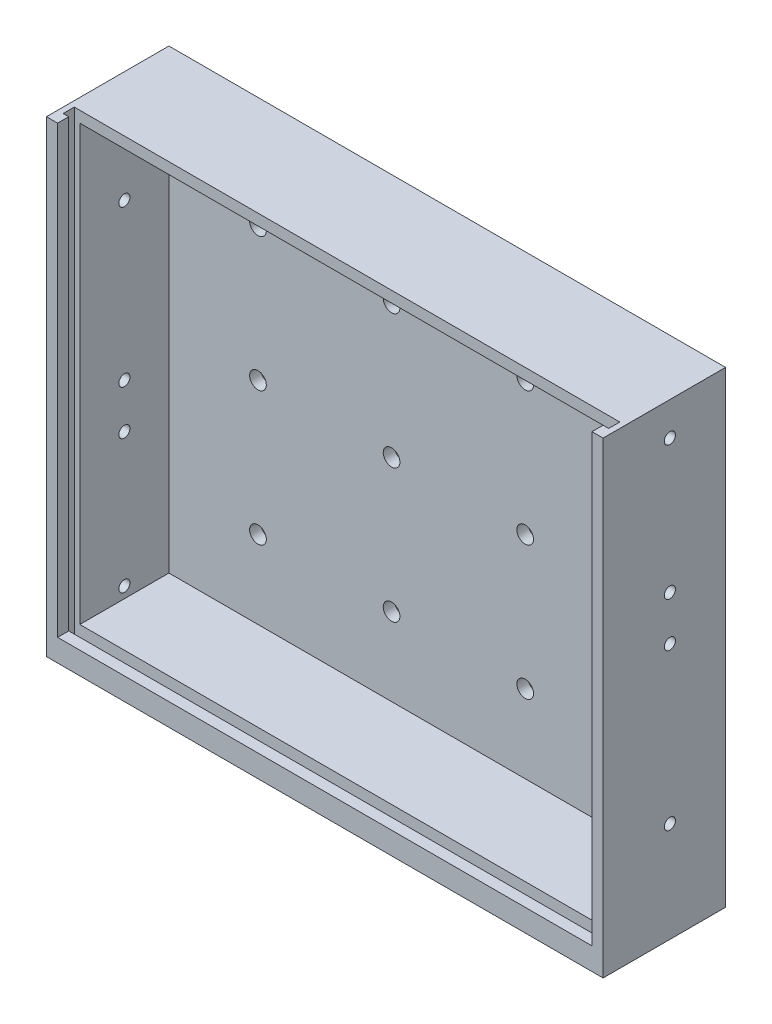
ISO-10303-21;
HEADER;
FILE_DESCRIPTION(('STEP AP214'),'2;1');
FILE_NAME('part.step','',(''),(''),'','','');
FILE_SCHEMA(('AUTOMOTIVE_DESIGN { 1 0 10303 214 1 1 1 1 }'));
ENDSEC;
DATA;
#1=APPLICATION_CONTEXT('core data for automotive mechanical design processes');
#2=APPLICATION_PROTOCOL_DEFINITION('international standard','automotive_design',2000,#1);
#3=PRODUCT_CONTEXT('',#1,'mechanical');
#4=PRODUCT('Part','Part','',(#3));
#5=PRODUCT_RELATED_PRODUCT_CATEGORY('part','',(#4));
#6=PRODUCT_DEFINITION_FORMATION('','',#4);
#7=PRODUCT_DEFINITION_CONTEXT('part definition',#1,'design');
#8=PRODUCT_DEFINITION('design','',#6,#7);
#9=PRODUCT_DEFINITION_SHAPE('','',#8);
#10=(LENGTH_UNIT() NAMED_UNIT(*) SI_UNIT(.MILLI.,.METRE.));
#11=(NAMED_UNIT(*) PLANE_ANGLE_UNIT() SI_UNIT($,.RADIAN.));
#12=(NAMED_UNIT(*) SI_UNIT($,.STERADIAN.) SOLID_ANGLE_UNIT());
#13=UNCERTAINTY_MEASURE_WITH_UNIT(LENGTH_MEASURE(1.E-05),#10,'distance_accuracy_value','');
#14=(GEOMETRIC_REPRESENTATION_CONTEXT(3) GLOBAL_UNCERTAINTY_ASSIGNED_CONTEXT((#13)) GLOBAL_UNIT_ASSIGNED_CONTEXT((#10,
#11,#12)) REPRESENTATION_CONTEXT('',''));
#15=CARTESIAN_POINT('',(0.,0.,0.));
#16=DIRECTION('',(0.,0.,1.));
#17=DIRECTION('',(1.,0.,0.));
#18=AXIS2_PLACEMENT_3D('',#15,#16,#17);
#19=CARTESIAN_POINT('',(0.,0.,6.35));
#20=DIRECTION('',(0.,0.,1.));
#21=DIRECTION('',(1.,0.,0.));
#22=AXIS2_PLACEMENT_3D('',#19,#20,#21);
#23=PLANE('',#22);
#24=CARTESIAN_POINT('',(285.75,-133.35,6.35));
#25=DIRECTION('',(0.,0.,1.));
#26=DIRECTION('',(1.,0.,0.));
#27=AXIS2_PLACEMENT_3D('',#24,#25,#26);
#28=CIRCLE('',#27,4.76250000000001);
#29=CARTESIAN_POINT('',(290.5125,-133.35,6.35));
#30=VERTEX_POINT('',#29);
#31=EDGE_CURVE('E495',#30,#30,#28,.T.);
#32=ORIENTED_EDGE('',*,*,#31,.F.);
#33=EDGE_LOOP('',(#32));
#34=FACE_BOUND('',#33,.T.);
#35=CARTESIAN_POINT('',(133.35,-133.35,6.35));
#36=DIRECTION('',(0.,0.,1.));
#37=DIRECTION('',(1.,0.,0.));
#38=AXIS2_PLACEMENT_3D('',#35,#36,#37);
#39=CIRCLE('',#38,4.7625);
#40=CARTESIAN_POINT('',(138.1125,-133.35,6.35));
#41=VERTEX_POINT('',#40);
#42=EDGE_CURVE('E499',#41,#41,#39,.T.);
#43=ORIENTED_EDGE('',*,*,#42,.F.);
#44=EDGE_LOOP('',(#43));
#45=FACE_BOUND('',#44,.T.);
#46=CARTESIAN_POINT('',(285.75,-209.55,6.35));
#47=DIRECTION('',(0.,0.,1.));
#48=DIRECTION('',(1.,0.,0.));
#49=AXIS2_PLACEMENT_3D('',#46,#47,#48);
#50=CIRCLE('',#49,4.76250000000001);
#51=CARTESIAN_POINT('',(290.5125,-209.55,6.35));
#52=VERTEX_POINT('',#51);
#53=EDGE_CURVE('E483',#52,#52,#50,.T.);
#54=ORIENTED_EDGE('',*,*,#53,.F.);
#55=EDGE_LOOP('',(#54));
#56=FACE_BOUND('',#55,.T.);
#57=CARTESIAN_POINT('',(133.35,-209.55,6.35));
#58=DIRECTION('',(0.,0.,1.));
#59=DIRECTION('',(1.,0.,0.));
#60=AXIS2_PLACEMENT_3D('',#57,#58,#59);
#61=CIRCLE('',#60,4.7625);
#62=CARTESIAN_POINT('',(138.1125,-209.55,6.35));
#63=VERTEX_POINT('',#62);
#64=EDGE_CURVE('E487',#63,#63,#61,.T.);
#65=ORIENTED_EDGE('',*,*,#64,.F.);
#66=EDGE_LOOP('',(#65));
#67=FACE_BOUND('',#66,.T.);
#68=CARTESIAN_POINT('',(285.75,-57.15,6.35));
#69=DIRECTION('',(0.,0.,1.));
#70=DIRECTION('',(1.,0.,0.));
#71=AXIS2_PLACEMENT_3D('',#68,#69,#70);
#72=CIRCLE('',#71,4.76250000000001);
#73=CARTESIAN_POINT('',(290.5125,-57.15,6.35));
#74=VERTEX_POINT('',#73);
#75=EDGE_CURVE('E491',#74,#74,#72,.T.);
#76=ORIENTED_EDGE('',*,*,#75,.F.);
#77=EDGE_LOOP('',(#76));
#78=FACE_BOUND('',#77,.T.);
#79=CARTESIAN_POINT('',(133.35,-57.15,6.35));
#80=DIRECTION('',(0.,0.,1.));
#81=DIRECTION('',(1.,0.,0.));
#82=AXIS2_PLACEMENT_3D('',#79,#80,#81);
#83=CIRCLE('',#82,4.7625);
#84=CARTESIAN_POINT('',(138.1125,-57.15,6.35));
#85=VERTEX_POINT('',#84);
#86=EDGE_CURVE('E479',#85,#85,#83,.T.);
#87=ORIENTED_EDGE('',*,*,#86,.F.);
#88=EDGE_LOOP('',(#87));
#89=FACE_BOUND('',#88,.T.);
#90=CARTESIAN_POINT('',(209.55,-133.35,6.35));
#91=DIRECTION('',(0.,0.,1.));
#92=DIRECTION('',(1.,0.,0.));
#93=AXIS2_PLACEMENT_3D('',#90,#91,#92);
#94=CIRCLE('',#93,4.76250000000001);
#95=CARTESIAN_POINT('',(214.3125,-133.35,6.35));
#96=VERTEX_POINT('',#95);
#97=EDGE_CURVE('E475',#96,#96,#94,.T.);
#98=ORIENTED_EDGE('',*,*,#97,.F.);
#99=EDGE_LOOP('',(#98));
#100=FACE_BOUND('',#99,.T.);
#101=CARTESIAN_POINT('',(57.15,-133.35,6.35));
#102=DIRECTION('',(0.,0.,1.));
#103=DIRECTION('',(1.,0.,0.));
#104=AXIS2_PLACEMENT_3D('',#101,#102,#103);
#105=CIRCLE('',#104,4.7625);
#106=CARTESIAN_POINT('',(61.9125,-133.35,6.35));
#107=VERTEX_POINT('',#106);
#108=EDGE_CURVE('E471',#107,#107,#105,.T.);
#109=ORIENTED_EDGE('',*,*,#108,.F.);
#110=EDGE_LOOP('',(#109));
#111=FACE_BOUND('',#110,.T.);
#112=CARTESIAN_POINT('',(209.55,-57.15,6.35));
#113=DIRECTION('',(0.,0.,1.));
#114=DIRECTION('',(1.,0.,0.));
#115=AXIS2_PLACEMENT_3D('',#112,#113,#114);
#116=CIRCLE('',#115,4.76250000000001);
#117=CARTESIAN_POINT('',(214.3125,-57.15,6.35));
#118=VERTEX_POINT('',#117);
#119=EDGE_CURVE('E410',#118,#118,#116,.T.);
#120=ORIENTED_EDGE('',*,*,#119,.F.);
#121=EDGE_LOOP('',(#120));
#122=FACE_BOUND('',#121,.T.);
#123=CARTESIAN_POINT('',(57.15,-209.55,6.35));
#124=DIRECTION('',(0.,0.,1.));
#125=DIRECTION('',(1.,0.,0.));
#126=AXIS2_PLACEMENT_3D('',#123,#124,#125);
#127=CIRCLE('',#126,4.7625);
#128=CARTESIAN_POINT('',(61.9125,-209.55,6.35));
#129=VERTEX_POINT('',#128);
#130=EDGE_CURVE('E418',#129,#129,#127,.T.);
#131=ORIENTED_EDGE('',*,*,#130,.F.);
#132=EDGE_LOOP('',(#131));
#133=FACE_BOUND('',#132,.T.);
#134=CARTESIAN_POINT('',(209.55,-209.55,6.35));
#135=DIRECTION('',(0.,0.,1.));
#136=DIRECTION('',(1.,0.,0.));
#137=AXIS2_PLACEMENT_3D('',#134,#135,#136);
#138=CIRCLE('',#137,4.76250000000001);
#139=CARTESIAN_POINT('',(214.3125,-209.55,6.35));
#140=VERTEX_POINT('',#139);
#141=EDGE_CURVE('E413',#140,#140,#138,.T.);
#142=ORIENTED_EDGE('',*,*,#141,.F.);
#143=EDGE_LOOP('',(#142));
#144=FACE_BOUND('',#143,.T.);
#145=CARTESIAN_POINT('',(57.15,-57.15,6.35));
#146=DIRECTION('',(0.,0.,1.));
#147=DIRECTION('',(1.,0.,0.));
#148=AXIS2_PLACEMENT_3D('',#145,#146,#147);
#149=CIRCLE('',#148,4.7625);
#150=CARTESIAN_POINT('',(61.9125,-57.15,6.35));
#151=VERTEX_POINT('',#150);
#152=EDGE_CURVE('E264',#151,#151,#149,.T.);
#153=ORIENTED_EDGE('',*,*,#152,.F.);
#154=EDGE_LOOP('',(#153));
#155=FACE_BOUND('',#154,.T.);
#156=DIRECTION('',(0.,1.,0.));
#157=VECTOR('',#156,1.);
#158=CARTESIAN_POINT('',(311.15,0.,6.35));
#159=LINE('',#158,#157);
#160=CARTESIAN_POINT('',(311.15,-254.,6.35));
#161=VERTEX_POINT('',#160);
#162=CARTESIAN_POINT('',(311.15,-6.35000000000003,6.35));
#163=VERTEX_POINT('',#162);
#164=EDGE_CURVE('E195',#161,#163,#159,.T.);
#165=ORIENTED_EDGE('',*,*,#164,.T.);
#166=DIRECTION('',(1.,0.,0.));
#167=VECTOR('',#166,1.);
#168=CARTESIAN_POINT('',(0.,-6.35000000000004,6.35));
#169=LINE('',#168,#167);
#170=CARTESIAN_POINT('',(6.35,-6.35000000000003,6.35));
#171=VERTEX_POINT('',#170);
#172=EDGE_CURVE('E153',#171,#163,#169,.T.);
#173=ORIENTED_EDGE('',*,*,#172,.F.);
#174=DIRECTION('',(0.,-1.,0.));
#175=VECTOR('',#174,1.);
#176=CARTESIAN_POINT('',(6.35,0.,6.35));
#177=LINE('',#176,#175);
#178=CARTESIAN_POINT('',(6.35000000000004,-254.,6.35));
#179=VERTEX_POINT('',#178);
#180=EDGE_CURVE('E162',#171,#179,#177,.T.);
#181=ORIENTED_EDGE('',*,*,#180,.T.);
#182=DIRECTION('',(1.,0.,0.));
#183=VECTOR('',#182,1.);
#184=CARTESIAN_POINT('',(0.,-254.,6.35));
#185=LINE('',#184,#183);
#186=EDGE_CURVE('E190',#179,#161,#185,.T.);
#187=ORIENTED_EDGE('',*,*,#186,.T.);
#188=EDGE_LOOP('',(#165,#173,#181,#187));
#189=FACE_BOUND('',#188,.T.);
#190=ADVANCED_FACE('F35',(#34,#45,#56,#67,#78,#89,#100,#111,#122,#133,#144,#155,#189),#23,.T.);
#191=CARTESIAN_POINT('',(6.35,0.,69.85));
#192=DIRECTION('',(1.,0.,0.));
#193=DIRECTION('',(0.,1.,0.));
#194=AXIS2_PLACEMENT_3D('',#191,#192,#193);
#195=PLANE('',#194);
#196=CARTESIAN_POINT('',(6.35000000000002,-146.05,31.75));
#197=DIRECTION('',(-1.,0.,0.));
#198=DIRECTION('',(0.,-1.,0.));
#199=AXIS2_PLACEMENT_3D('',#196,#197,#198);
#200=CIRCLE('',#199,3.175);
#201=CARTESIAN_POINT('',(6.35000000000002,-149.225,31.75));
#202=VERTEX_POINT('',#201);
#203=EDGE_CURVE('E427',#202,#202,#200,.T.);
#204=ORIENTED_EDGE('',*,*,#203,.T.);
#205=EDGE_LOOP('',(#204));
#206=FACE_BOUND('',#205,.T.);
#207=CARTESIAN_POINT('',(6.35000000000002,-171.45,31.75));
#208=DIRECTION('',(-1.,0.,0.));
#209=DIRECTION('',(0.,-1.,0.));
#210=AXIS2_PLACEMENT_3D('',#207,#208,#209);
#211=CIRCLE('',#210,3.175);
#212=CARTESIAN_POINT('',(6.35000000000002,-174.625,31.75));
#213=VERTEX_POINT('',#212);
#214=EDGE_CURVE('E440',#213,#213,#211,.T.);
#215=ORIENTED_EDGE('',*,*,#214,.T.);
#216=EDGE_LOOP('',(#215));
#217=FACE_BOUND('',#216,.T.);
#218=CARTESIAN_POINT('',(6.35000000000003,-247.65,31.75));
#219=DIRECTION('',(-1.,0.,0.));
#220=DIRECTION('',(0.,-1.,0.));
#221=AXIS2_PLACEMENT_3D('',#218,#219,#220);
#222=CIRCLE('',#221,3.175);
#223=CARTESIAN_POINT('',(6.35000000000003,-250.825,31.75));
#224=VERTEX_POINT('',#223);
#225=EDGE_CURVE('E433',#224,#224,#222,.T.);
#226=ORIENTED_EDGE('',*,*,#225,.T.);
#227=EDGE_LOOP('',(#226));
#228=FACE_BOUND('',#227,.T.);
#229=CARTESIAN_POINT('',(6.35000000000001,-57.15,31.75));
#230=DIRECTION('',(-1.,0.,0.));
#231=DIRECTION('',(0.,-1.,0.));
#232=AXIS2_PLACEMENT_3D('',#229,#230,#231);
#233=CIRCLE('',#232,3.175);
#234=CARTESIAN_POINT('',(6.35000000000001,-60.325,31.75));
#235=VERTEX_POINT('',#234);
#236=EDGE_CURVE('E416',#235,#235,#233,.T.);
#237=ORIENTED_EDGE('',*,*,#236,.T.);
#238=EDGE_LOOP('',(#237));
#239=FACE_BOUND('',#238,.T.);
#240=ORIENTED_EDGE('',*,*,#180,.F.);
#241=DIRECTION('',(0.,0.,-1.));
#242=VECTOR('',#241,1.);
#243=CARTESIAN_POINT('',(6.35,-6.35000000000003,57.15));
#244=LINE('',#243,#242);
#245=CARTESIAN_POINT('',(6.35,-6.35000000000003,57.15));
#246=VERTEX_POINT('',#245);
#247=EDGE_CURVE('E148',#246,#171,#244,.T.);
#248=ORIENTED_EDGE('',*,*,#247,.F.);
#249=DIRECTION('',(0.,1.,0.));
#250=VECTOR('',#249,1.);
#251=CARTESIAN_POINT('',(6.35,0.,57.15));
#252=LINE('',#251,#250);
#253=CARTESIAN_POINT('',(6.35000000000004,-254.,57.15));
#254=VERTEX_POINT('',#253);
#255=EDGE_CURVE('E160',#254,#246,#252,.T.);
#256=ORIENTED_EDGE('',*,*,#255,.F.);
#257=DIRECTION('',(0.,0.,-1.));
#258=VECTOR('',#257,1.);
#259=CARTESIAN_POINT('',(6.35000000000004,-254.,69.85));
#260=LINE('',#259,#258);
#261=EDGE_CURVE('E229',#254,#179,#260,.T.);
#262=ORIENTED_EDGE('',*,*,#261,.T.);
#263=EDGE_LOOP('',(#240,#248,#256,#262));
#264=FACE_BOUND('',#263,.T.);
#265=ADVANCED_FACE('F158',(#206,#217,#228,#239,#264),#195,.T.);
#266=CARTESIAN_POINT('',(311.15,0.,69.85));
#267=DIRECTION('',(-1.,0.,0.));
#268=DIRECTION('',(0.,0.,1.));
#269=AXIS2_PLACEMENT_3D('',#266,#267,#268);
#270=PLANE('',#269);
#271=CARTESIAN_POINT('',(311.15,-120.65,31.75));
#272=DIRECTION('',(1.,0.,0.));
#273=DIRECTION('',(0.,1.,0.));
#274=AXIS2_PLACEMENT_3D('',#271,#272,#273);
#275=CIRCLE('',#274,3.175);
#276=CARTESIAN_POINT('',(311.15,-117.475,31.75));
#277=VERTEX_POINT('',#276);
#278=EDGE_CURVE('E451',#277,#277,#275,.T.);
#279=ORIENTED_EDGE('',*,*,#278,.T.);
#280=EDGE_LOOP('',(#279));
#281=FACE_BOUND('',#280,.T.);
#282=CARTESIAN_POINT('',(311.15,-95.25,31.75));
#283=DIRECTION('',(1.,0.,0.));
#284=DIRECTION('',(0.,1.,0.));
#285=AXIS2_PLACEMENT_3D('',#282,#283,#284);
#286=CIRCLE('',#285,3.175);
#287=CARTESIAN_POINT('',(311.15,-92.075,31.75));
#288=VERTEX_POINT('',#287);
#289=EDGE_CURVE('E463',#288,#288,#286,.T.);
#290=ORIENTED_EDGE('',*,*,#289,.T.);
#291=EDGE_LOOP('',(#290));
#292=FACE_BOUND('',#291,.T.);
#293=CARTESIAN_POINT('',(311.15,-19.05,31.75));
#294=DIRECTION('',(1.,0.,0.));
#295=DIRECTION('',(0.,1.,0.));
#296=AXIS2_PLACEMENT_3D('',#293,#294,#295);
#297=CIRCLE('',#296,3.175);
#298=CARTESIAN_POINT('',(311.15,-15.875,31.75));
#299=VERTEX_POINT('',#298);
#300=EDGE_CURVE('E457',#299,#299,#297,.T.);
#301=ORIENTED_EDGE('',*,*,#300,.T.);
#302=EDGE_LOOP('',(#301));
#303=FACE_BOUND('',#302,.T.);
#304=CARTESIAN_POINT('',(311.15,-209.55,31.75));
#305=DIRECTION('',(1.,0.,0.));
#306=DIRECTION('',(0.,1.,0.));
#307=AXIS2_PLACEMENT_3D('',#304,#305,#306);
#308=CIRCLE('',#307,3.175);
#309=CARTESIAN_POINT('',(311.15,-206.375,31.75));
#310=VERTEX_POINT('',#309);
#311=EDGE_CURVE('E434',#310,#310,#308,.T.);
#312=ORIENTED_EDGE('',*,*,#311,.T.);
#313=EDGE_LOOP('',(#312));
#314=FACE_BOUND('',#313,.T.);
#315=DIRECTION('',(0.,-1.,0.));
#316=VECTOR('',#315,1.);
#317=CARTESIAN_POINT('',(311.15,0.,57.15));
#318=LINE('',#317,#316);
#319=CARTESIAN_POINT('',(311.15,-6.35000000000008,57.15));
#320=VERTEX_POINT('',#319);
#321=CARTESIAN_POINT('',(311.15,-254.,57.15));
#322=VERTEX_POINT('',#321);
#323=EDGE_CURVE('E43',#320,#322,#318,.T.);
#324=ORIENTED_EDGE('',*,*,#323,.F.);
#325=DIRECTION('',(0.,0.,-1.));
#326=VECTOR('',#325,1.);
#327=CARTESIAN_POINT('',(311.15,-6.35000000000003,57.15));
#328=LINE('',#327,#326);
#329=EDGE_CURVE('E50',#320,#163,#328,.T.);
#330=ORIENTED_EDGE('',*,*,#329,.T.);
#331=ORIENTED_EDGE('',*,*,#164,.F.);
#332=DIRECTION('',(0.,0.,-1.));
#333=VECTOR('',#332,1.);
#334=CARTESIAN_POINT('',(311.15,-254.,69.85));
#335=LINE('',#334,#333);
#336=EDGE_CURVE('E214',#322,#161,#335,.T.);
#337=ORIENTED_EDGE('',*,*,#336,.F.);
#338=EDGE_LOOP('',(#324,#330,#331,#337));
#339=FACE_BOUND('',#338,.T.);
#340=ADVANCED_FACE('F259',(#281,#292,#303,#314,#339),#270,.T.);
#341=CARTESIAN_POINT('',(0.,-254.,69.85));
#342=DIRECTION('',(0.,1.,0.));
#343=DIRECTION('',(0.,0.,1.));
#344=AXIS2_PLACEMENT_3D('',#341,#342,#343);
#345=PLANE('',#344);
#346=DIRECTION('',(1.,0.,0.));
#347=VECTOR('',#346,1.);
#348=CARTESIAN_POINT('',(0.,-254.,63.5));
#349=LINE('',#348,#347);
#350=CARTESIAN_POINT('',(6.35000000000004,-254.,63.5));
#351=VERTEX_POINT('',#350);
#352=CARTESIAN_POINT('',(311.15,-254.,63.5));
#353=VERTEX_POINT('',#352);
#354=EDGE_CURVE('E172',#351,#353,#349,.T.);
#355=ORIENTED_EDGE('',*,*,#354,.F.);
#356=CARTESIAN_POINT('',(6.35000000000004,-254.,69.85));
#357=VERTEX_POINT('',#356);
#358=EDGE_CURVE('E230',#357,#351,#260,.T.);
#359=ORIENTED_EDGE('',*,*,#358,.F.);
#360=DIRECTION('',(1.,0.,0.));
#361=VECTOR('',#360,1.);
#362=CARTESIAN_POINT('',(0.,-254.,69.85));
#363=LINE('',#362,#361);
#364=CARTESIAN_POINT('',(311.15,-254.,69.85));
#365=VERTEX_POINT('',#364);
#366=EDGE_CURVE('E191',#357,#365,#363,.T.);
#367=ORIENTED_EDGE('',*,*,#366,.T.);
#368=EDGE_CURVE('E220',#365,#353,#335,.T.);
#369=ORIENTED_EDGE('',*,*,#368,.T.);
#370=EDGE_LOOP('',(#355,#359,#367,#369));
#371=FACE_BOUND('',#370,.T.);
#372=ADVANCED_FACE('F311',(#371),#345,.T.);
#373=DIRECTION('',(0.,-1.,0.));
#374=VECTOR('',#373,1.);
#375=CARTESIAN_POINT('',(6.35,0.,63.5));
#376=LINE('',#375,#374);
#377=CARTESIAN_POINT('',(6.35000000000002,0.,63.5));
#378=VERTEX_POINT('',#377);
#379=EDGE_CURVE('E179',#378,#351,#376,.T.);
#380=ORIENTED_EDGE('',*,*,#379,.F.);
#381=DIRECTION('',(0.,0.,-1.));
#382=VECTOR('',#381,1.);
#383=CARTESIAN_POINT('',(6.35000000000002,0.,69.85));
#384=LINE('',#383,#382);
#385=CARTESIAN_POINT('',(6.35000000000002,0.,69.85));
#386=VERTEX_POINT('',#385);
#387=EDGE_CURVE('E226',#386,#378,#384,.T.);
#388=ORIENTED_EDGE('',*,*,#387,.F.);
#389=DIRECTION('',(0.,-1.,0.));
#390=VECTOR('',#389,1.);
#391=CARTESIAN_POINT('',(6.35,0.,69.85));
#392=LINE('',#391,#390);
#393=EDGE_CURVE('E194',#386,#357,#392,.T.);
#394=ORIENTED_EDGE('',*,*,#393,.T.);
#395=ORIENTED_EDGE('',*,*,#358,.T.);
#396=EDGE_LOOP('',(#380,#388,#394,#395));
#397=FACE_BOUND('',#396,.T.);
#398=ADVANCED_FACE('F307',(#397),#195,.T.);
#399=DIRECTION('',(0.,1.,0.));
#400=VECTOR('',#399,1.);
#401=CARTESIAN_POINT('',(311.15,0.,63.5));
#402=LINE('',#401,#400);
#403=CARTESIAN_POINT('',(311.15,0.,63.5));
#404=VERTEX_POINT('',#403);
#405=EDGE_CURVE('E11',#353,#404,#402,.T.);
#406=ORIENTED_EDGE('',*,*,#405,.F.);
#407=ORIENTED_EDGE('',*,*,#368,.F.);
#408=DIRECTION('',(0.,1.,0.));
#409=VECTOR('',#408,1.);
#410=CARTESIAN_POINT('',(311.15,0.,69.85));
#411=LINE('',#410,#409);
#412=CARTESIAN_POINT('',(311.15,0.,69.85));
#413=VERTEX_POINT('',#412);
#414=EDGE_CURVE('E211',#365,#413,#411,.T.);
#415=ORIENTED_EDGE('',*,*,#414,.T.);
#416=DIRECTION('',(0.,0.,-1.));
#417=VECTOR('',#416,1.);
#418=CARTESIAN_POINT('',(311.15,0.,69.85));
#419=LINE('',#418,#417);
#420=EDGE_CURVE('E223',#413,#404,#419,.T.);
#421=ORIENTED_EDGE('',*,*,#420,.T.);
#422=EDGE_LOOP('',(#406,#407,#415,#421));
#423=FACE_BOUND('',#422,.T.);
#424=ADVANCED_FACE('F317',(#423),#270,.T.);
#425=CARTESIAN_POINT('',(0.,0.,6.35));
#426=DIRECTION('',(1.,0.,0.));
#427=DIRECTION('',(0.,1.,0.));
#428=AXIS2_PLACEMENT_3D('',#425,#426,#427);
#429=PLANE('',#428);
#430=CARTESIAN_POINT('',(0.,-146.05,31.75));
#431=DIRECTION('',(-1.,0.,0.));
#432=DIRECTION('',(0.,-1.,0.));
#433=AXIS2_PLACEMENT_3D('',#430,#431,#432);
#434=CIRCLE('',#433,3.175);
#435=CARTESIAN_POINT('',(0.,-149.225,31.75));
#436=VERTEX_POINT('',#435);
#437=EDGE_CURVE('E443',#436,#436,#434,.T.);
#438=ORIENTED_EDGE('',*,*,#437,.F.);
#439=EDGE_LOOP('',(#438));
#440=FACE_BOUND('',#439,.T.);
#441=CARTESIAN_POINT('',(0.,-171.45,31.75));
#442=DIRECTION('',(-1.,0.,0.));
#443=DIRECTION('',(0.,-1.,0.));
#444=AXIS2_PLACEMENT_3D('',#441,#442,#443);
#445=CIRCLE('',#444,3.175);
#446=CARTESIAN_POINT('',(0.,-174.625,31.75));
#447=VERTEX_POINT('',#446);
#448=EDGE_CURVE('E437',#447,#447,#445,.T.);
#449=ORIENTED_EDGE('',*,*,#448,.F.);
#450=EDGE_LOOP('',(#449));
#451=FACE_BOUND('',#450,.T.);
#452=CARTESIAN_POINT('',(0.,-247.65,31.75));
#453=DIRECTION('',(-1.,0.,0.));
#454=DIRECTION('',(0.,-1.,0.));
#455=AXIS2_PLACEMENT_3D('',#452,#453,#454);
#456=CIRCLE('',#455,3.175);
#457=CARTESIAN_POINT('',(0.,-250.825,31.75));
#458=VERTEX_POINT('',#457);
#459=EDGE_CURVE('E430',#458,#458,#456,.T.);
#460=ORIENTED_EDGE('',*,*,#459,.F.);
#461=EDGE_LOOP('',(#460));
#462=FACE_BOUND('',#461,.T.);
#463=CARTESIAN_POINT('',(0.,-57.15,31.75));
#464=DIRECTION('',(-1.,0.,0.));
#465=DIRECTION('',(0.,-1.,0.));
#466=AXIS2_PLACEMENT_3D('',#463,#464,#465);
#467=CIRCLE('',#466,3.175);
#468=CARTESIAN_POINT('',(0.,-60.325,31.75));
#469=VERTEX_POINT('',#468);
#470=EDGE_CURVE('E424',#469,#469,#467,.T.);
#471=ORIENTED_EDGE('',*,*,#470,.F.);
#472=EDGE_LOOP('',(#471));
#473=FACE_BOUND('',#472,.T.);
#474=DIRECTION('',(0.,-1.,0.));
#475=VECTOR('',#474,1.);
#476=CARTESIAN_POINT('',(0.,0.,0.));
#477=LINE('',#476,#475);
#478=CARTESIAN_POINT('',(0.,0.,0.));
#479=VERTEX_POINT('',#478);
#480=CARTESIAN_POINT('',(0.,-266.7,0.));
#481=VERTEX_POINT('',#480);
#482=EDGE_CURVE('E233',#479,#481,#477,.T.);
#483=ORIENTED_EDGE('',*,*,#482,.T.);
#484=DIRECTION('',(0.,0.,-1.));
#485=VECTOR('',#484,1.);
#486=CARTESIAN_POINT('',(0.,-266.7,6.35));
#487=LINE('',#486,#485);
#488=CARTESIAN_POINT('',(0.,-266.7,69.85));
#489=VERTEX_POINT('',#488);
#490=EDGE_CURVE('E251',#489,#481,#487,.T.);
#491=ORIENTED_EDGE('',*,*,#490,.F.);
#492=DIRECTION('',(0.,-1.,0.));
#493=VECTOR('',#492,1.);
#494=CARTESIAN_POINT('',(0.,0.,69.85));
#495=LINE('',#494,#493);
#496=CARTESIAN_POINT('',(0.,0.,69.85));
#497=VERTEX_POINT('',#496);
#498=EDGE_CURVE('E201',#497,#489,#495,.T.);
#499=ORIENTED_EDGE('',*,*,#498,.F.);
#500=DIRECTION('',(0.,0.,-1.));
#501=VECTOR('',#500,1.);
#502=CARTESIAN_POINT('',(0.,0.,6.35));
#503=LINE('',#502,#501);
#504=EDGE_CURVE('E242',#497,#479,#503,.T.);
#505=ORIENTED_EDGE('',*,*,#504,.T.);
#506=EDGE_LOOP('',(#483,#491,#499,#505));
#507=FACE_BOUND('',#506,.T.);
#508=ADVANCED_FACE('F37',(#440,#451,#462,#473,#507),#429,.F.);
#509=CARTESIAN_POINT('',(0.,-266.7,6.35));
#510=DIRECTION('',(0.,1.,0.));
#511=DIRECTION('',(0.,0.,1.));
#512=AXIS2_PLACEMENT_3D('',#509,#510,#511);
#513=PLANE('',#512);
#514=DIRECTION('',(0.,0.,1.));
#515=VECTOR('',#514,1.);
#516=CARTESIAN_POINT('',(3.17500000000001,-266.7,6.35));
#517=LINE('',#516,#515);
#518=CARTESIAN_POINT('',(3.17500000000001,-266.7,57.15));
#519=VERTEX_POINT('',#518);
#520=CARTESIAN_POINT('',(3.17500000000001,-266.7,63.5));
#521=VERTEX_POINT('',#520);
#522=EDGE_CURVE('E187',#519,#521,#517,.T.);
#523=ORIENTED_EDGE('',*,*,#522,.T.);
#524=DIRECTION('',(1.,0.,0.));
#525=VECTOR('',#524,1.);
#526=CARTESIAN_POINT('',(0.,-266.7,63.5));
#527=LINE('',#526,#525);
#528=CARTESIAN_POINT('',(314.325,-266.7,63.5));
#529=VERTEX_POINT('',#528);
#530=EDGE_CURVE('E181',#521,#529,#527,.T.);
#531=ORIENTED_EDGE('',*,*,#530,.T.);
#532=DIRECTION('',(0.,0.,-1.));
#533=VECTOR('',#532,1.);
#534=CARTESIAN_POINT('',(314.325,-266.7,6.35));
#535=LINE('',#534,#533);
#536=CARTESIAN_POINT('',(314.325,-266.7,57.15));
#537=VERTEX_POINT('',#536);
#538=EDGE_CURVE('E184',#529,#537,#535,.T.);
#539=ORIENTED_EDGE('',*,*,#538,.T.);
#540=DIRECTION('',(-1.,0.,0.));
#541=VECTOR('',#540,1.);
#542=CARTESIAN_POINT('',(0.,-266.7,57.15));
#543=LINE('',#542,#541);
#544=EDGE_CURVE('E169',#537,#519,#543,.T.);
#545=ORIENTED_EDGE('',*,*,#544,.T.);
#546=EDGE_LOOP('',(#523,#531,#539,#545));
#547=FACE_BOUND('',#546,.T.);
#548=DIRECTION('',(1.,0.,0.));
#549=VECTOR('',#548,1.);
#550=CARTESIAN_POINT('',(0.,-266.7,0.));
#551=LINE('',#550,#549);
#552=CARTESIAN_POINT('',(317.5,-266.7,0.));
#553=VERTEX_POINT('',#552);
#554=EDGE_CURVE('E236',#481,#553,#551,.T.);
#555=ORIENTED_EDGE('',*,*,#554,.T.);
#556=DIRECTION('',(0.,0.,-1.));
#557=VECTOR('',#556,1.);
#558=CARTESIAN_POINT('',(317.5,-266.7,6.35));
#559=LINE('',#558,#557);
#560=CARTESIAN_POINT('',(317.5,-266.7,69.85));
#561=VERTEX_POINT('',#560);
#562=EDGE_CURVE('E248',#561,#553,#559,.T.);
#563=ORIENTED_EDGE('',*,*,#562,.F.);
#564=DIRECTION('',(1.,0.,0.));
#565=VECTOR('',#564,1.);
#566=CARTESIAN_POINT('',(0.,-266.7,69.85));
#567=LINE('',#566,#565);
#568=EDGE_CURVE('E205',#489,#561,#567,.T.);
#569=ORIENTED_EDGE('',*,*,#568,.F.);
#570=ORIENTED_EDGE('',*,*,#490,.T.);
#571=EDGE_LOOP('',(#555,#563,#569,#570));
#572=FACE_BOUND('',#571,.T.);
#573=ADVANCED_FACE('F298',(#547,#572),#513,.F.);
#574=CARTESIAN_POINT('',(317.5,0.,6.35));
#575=DIRECTION('',(-1.,0.,0.));
#576=DIRECTION('',(0.,-1.,0.));
#577=AXIS2_PLACEMENT_3D('',#574,#575,#576);
#578=PLANE('',#577);
#579=CARTESIAN_POINT('',(317.5,-120.65,31.75));
#580=DIRECTION('',(1.,0.,0.));
#581=DIRECTION('',(0.,1.,0.));
#582=AXIS2_PLACEMENT_3D('',#579,#580,#581);
#583=CIRCLE('',#582,3.175);
#584=CARTESIAN_POINT('',(317.5,-117.475,31.75));
#585=VERTEX_POINT('',#584);
#586=EDGE_CURVE('E466',#585,#585,#583,.T.);
#587=ORIENTED_EDGE('',*,*,#586,.F.);
#588=EDGE_LOOP('',(#587));
#589=FACE_BOUND('',#588,.T.);
#590=CARTESIAN_POINT('',(317.5,-95.25,31.75));
#591=DIRECTION('',(1.,0.,0.));
#592=DIRECTION('',(0.,1.,0.));
#593=AXIS2_PLACEMENT_3D('',#590,#591,#592);
#594=CIRCLE('',#593,3.175);
#595=CARTESIAN_POINT('',(317.5,-92.075,31.75));
#596=VERTEX_POINT('',#595);
#597=EDGE_CURVE('E460',#596,#596,#594,.T.);
#598=ORIENTED_EDGE('',*,*,#597,.F.);
#599=EDGE_LOOP('',(#598));
#600=FACE_BOUND('',#599,.T.);
#601=CARTESIAN_POINT('',(317.5,-19.05,31.75));
#602=DIRECTION('',(1.,0.,0.));
#603=DIRECTION('',(0.,1.,0.));
#604=AXIS2_PLACEMENT_3D('',#601,#602,#603);
#605=CIRCLE('',#604,3.175);
#606=CARTESIAN_POINT('',(317.5,-15.875,31.75));
#607=VERTEX_POINT('',#606);
#608=EDGE_CURVE('E454',#607,#607,#605,.T.);
#609=ORIENTED_EDGE('',*,*,#608,.F.);
#610=EDGE_LOOP('',(#609));
#611=FACE_BOUND('',#610,.T.);
#612=CARTESIAN_POINT('',(317.5,-209.55,31.75));
#613=DIRECTION('',(1.,0.,0.));
#614=DIRECTION('',(0.,1.,0.));
#615=AXIS2_PLACEMENT_3D('',#612,#613,#614);
#616=CIRCLE('',#615,3.175);
#617=CARTESIAN_POINT('',(317.5,-206.375,31.75));
#618=VERTEX_POINT('',#617);
#619=EDGE_CURVE('E448',#618,#618,#616,.T.);
#620=ORIENTED_EDGE('',*,*,#619,.F.);
#621=EDGE_LOOP('',(#620));
#622=FACE_BOUND('',#621,.T.);
#623=DIRECTION('',(0.,1.,0.));
#624=VECTOR('',#623,1.);
#625=CARTESIAN_POINT('',(317.5,0.,0.));
#626=LINE('',#625,#624);
#627=CARTESIAN_POINT('',(317.5,0.,0.));
#628=VERTEX_POINT('',#627);
#629=EDGE_CURVE('E238',#553,#628,#626,.T.);
#630=ORIENTED_EDGE('',*,*,#629,.T.);
#631=DIRECTION('',(0.,0.,-1.));
#632=VECTOR('',#631,1.);
#633=CARTESIAN_POINT('',(317.5,0.,6.35));
#634=LINE('',#633,#632);
#635=CARTESIAN_POINT('',(317.5,0.,69.85));
#636=VERTEX_POINT('',#635);
#637=EDGE_CURVE('E245',#636,#628,#634,.T.);
#638=ORIENTED_EDGE('',*,*,#637,.F.);
#639=DIRECTION('',(0.,1.,0.));
#640=VECTOR('',#639,1.);
#641=CARTESIAN_POINT('',(317.5,0.,69.85));
#642=LINE('',#641,#640);
#643=EDGE_CURVE('E208',#561,#636,#642,.T.);
#644=ORIENTED_EDGE('',*,*,#643,.F.);
#645=ORIENTED_EDGE('',*,*,#562,.T.);
#646=EDGE_LOOP('',(#630,#638,#644,#645));
#647=FACE_BOUND('',#646,.T.);
#648=ADVANCED_FACE('F328',(#589,#600,#611,#622,#647),#578,.F.);
#649=CARTESIAN_POINT('',(0.,0.,6.35));
#650=DIRECTION('',(0.,-1.,0.));
#651=DIRECTION('',(0.,0.,-1.));
#652=AXIS2_PLACEMENT_3D('',#649,#650,#651);
#653=PLANE('',#652);
#654=ORIENTED_EDGE('',*,*,#387,.T.);
#655=DIRECTION('',(1.,0.,0.));
#656=VECTOR('',#655,1.);
#657=CARTESIAN_POINT('',(314.325,0.,63.5));
#658=LINE('',#657,#656);
#659=CARTESIAN_POINT('',(3.17500000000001,0.,63.5));
#660=VERTEX_POINT('',#659);
#661=EDGE_CURVE('E269',#660,#378,#658,.T.);
#662=ORIENTED_EDGE('',*,*,#661,.F.);
#663=DIRECTION('',(0.,0.,1.));
#664=VECTOR('',#663,1.);
#665=CARTESIAN_POINT('',(3.17500000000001,0.,63.5));
#666=LINE('',#665,#664);
#667=CARTESIAN_POINT('',(3.17500000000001,0.,57.15));
#668=VERTEX_POINT('',#667);
#669=EDGE_CURVE('E276',#668,#660,#666,.T.);
#670=ORIENTED_EDGE('',*,*,#669,.F.);
#671=DIRECTION('',(-1.,0.,0.));
#672=VECTOR('',#671,1.);
#673=CARTESIAN_POINT('',(3.17500000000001,0.,57.15));
#674=LINE('',#673,#672);
#675=CARTESIAN_POINT('',(314.325,0.,57.15));
#676=VERTEX_POINT('',#675);
#677=EDGE_CURVE('E273',#676,#668,#674,.T.);
#678=ORIENTED_EDGE('',*,*,#677,.F.);
#679=DIRECTION('',(0.,0.,-1.));
#680=VECTOR('',#679,1.);
#681=CARTESIAN_POINT('',(314.325,0.,57.15));
#682=LINE('',#681,#680);
#683=CARTESIAN_POINT('',(314.325,0.,63.5));
#684=VERTEX_POINT('',#683);
#685=EDGE_CURVE('E271',#684,#676,#682,.T.);
#686=ORIENTED_EDGE('',*,*,#685,.F.);
#687=EDGE_CURVE('E163',#404,#684,#658,.T.);
#688=ORIENTED_EDGE('',*,*,#687,.F.);
#689=ORIENTED_EDGE('',*,*,#420,.F.);
#690=DIRECTION('',(-1.,0.,0.));
#691=VECTOR('',#690,1.);
#692=CARTESIAN_POINT('',(0.,0.,69.85));
#693=LINE('',#692,#691);
#694=EDGE_CURVE('E202',#636,#413,#693,.T.);
#695=ORIENTED_EDGE('',*,*,#694,.F.);
#696=ORIENTED_EDGE('',*,*,#637,.T.);
#697=DIRECTION('',(-1.,0.,0.));
#698=VECTOR('',#697,1.);
#699=CARTESIAN_POINT('',(0.,0.,0.));
#700=LINE('',#699,#698);
#701=EDGE_CURVE('E240',#628,#479,#700,.T.);
#702=ORIENTED_EDGE('',*,*,#701,.T.);
#703=ORIENTED_EDGE('',*,*,#504,.F.);
#704=EDGE_CURVE('E198',#386,#497,#693,.T.);
#705=ORIENTED_EDGE('',*,*,#704,.F.);
#706=EDGE_LOOP('',(#654,#662,#670,#678,#686,#688,#689,#695,#696,#702,#703,#705));
#707=FACE_BOUND('',#706,.T.);
#708=ADVANCED_FACE('F293',(#707),#653,.F.);
#709=CARTESIAN_POINT('',(0.,0.,0.));
#710=DIRECTION('',(0.,0.,1.));
#711=DIRECTION('',(1.,0.,0.));
#712=AXIS2_PLACEMENT_3D('',#709,#710,#711);
#713=PLANE('',#712);
#714=CARTESIAN_POINT('',(285.75,-133.35,0.));
#715=DIRECTION('',(0.,0.,1.));
#716=DIRECTION('',(1.,0.,0.));
#717=AXIS2_PLACEMENT_3D('',#714,#715,#716);
#718=CIRCLE('',#717,4.76250000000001);
#719=CARTESIAN_POINT('',(290.5125,-133.35,0.));
#720=VERTEX_POINT('',#719);
#721=EDGE_CURVE('E359',#720,#720,#718,.T.);
#722=ORIENTED_EDGE('',*,*,#721,.T.);
#723=EDGE_LOOP('',(#722));
#724=FACE_BOUND('',#723,.T.);
#725=CARTESIAN_POINT('',(133.35,-133.35,0.));
#726=DIRECTION('',(0.,0.,1.));
#727=DIRECTION('',(1.,0.,0.));
#728=AXIS2_PLACEMENT_3D('',#725,#726,#727);
#729=CIRCLE('',#728,4.7625);
#730=CARTESIAN_POINT('',(138.1125,-133.35,0.));
#731=VERTEX_POINT('',#730);
#732=EDGE_CURVE('E363',#731,#731,#729,.T.);
#733=ORIENTED_EDGE('',*,*,#732,.T.);
#734=EDGE_LOOP('',(#733));
#735=FACE_BOUND('',#734,.T.);
#736=CARTESIAN_POINT('',(285.75,-209.55,0.));
#737=DIRECTION('',(0.,0.,1.));
#738=DIRECTION('',(1.,0.,0.));
#739=AXIS2_PLACEMENT_3D('',#736,#737,#738);
#740=CIRCLE('',#739,4.76250000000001);
#741=CARTESIAN_POINT('',(290.5125,-209.55,0.));
#742=VERTEX_POINT('',#741);
#743=EDGE_CURVE('E367',#742,#742,#740,.T.);
#744=ORIENTED_EDGE('',*,*,#743,.T.);
#745=EDGE_LOOP('',(#744));
#746=FACE_BOUND('',#745,.T.);
#747=CARTESIAN_POINT('',(133.35,-209.55,0.));
#748=DIRECTION('',(0.,0.,1.));
#749=DIRECTION('',(1.,0.,0.));
#750=AXIS2_PLACEMENT_3D('',#747,#748,#749);
#751=CIRCLE('',#750,4.7625);
#752=CARTESIAN_POINT('',(138.1125,-209.55,0.));
#753=VERTEX_POINT('',#752);
#754=EDGE_CURVE('E371',#753,#753,#751,.T.);
#755=ORIENTED_EDGE('',*,*,#754,.T.);
#756=EDGE_LOOP('',(#755));
#757=FACE_BOUND('',#756,.T.);
#758=CARTESIAN_POINT('',(285.75,-57.15,0.));
#759=DIRECTION('',(0.,0.,1.));
#760=DIRECTION('',(1.,0.,0.));
#761=AXIS2_PLACEMENT_3D('',#758,#759,#760);
#762=CIRCLE('',#761,4.76250000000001);
#763=CARTESIAN_POINT('',(290.5125,-57.15,0.));
#764=VERTEX_POINT('',#763);
#765=EDGE_CURVE('E375',#764,#764,#762,.T.);
#766=ORIENTED_EDGE('',*,*,#765,.T.);
#767=EDGE_LOOP('',(#766));
#768=FACE_BOUND('',#767,.T.);
#769=CARTESIAN_POINT('',(133.35,-57.15,0.));
#770=DIRECTION('',(0.,0.,1.));
#771=DIRECTION('',(1.,0.,0.));
#772=AXIS2_PLACEMENT_3D('',#769,#770,#771);
#773=CIRCLE('',#772,4.7625);
#774=CARTESIAN_POINT('',(138.1125,-57.15,0.));
#775=VERTEX_POINT('',#774);
#776=EDGE_CURVE('E379',#775,#775,#773,.T.);
#777=ORIENTED_EDGE('',*,*,#776,.T.);
#778=EDGE_LOOP('',(#777));
#779=FACE_BOUND('',#778,.T.);
#780=CARTESIAN_POINT('',(209.55,-133.35,0.));
#781=DIRECTION('',(0.,0.,1.));
#782=DIRECTION('',(1.,0.,0.));
#783=AXIS2_PLACEMENT_3D('',#780,#781,#782);
#784=CIRCLE('',#783,4.76250000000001);
#785=CARTESIAN_POINT('',(214.3125,-133.35,0.));
#786=VERTEX_POINT('',#785);
#787=EDGE_CURVE('E383',#786,#786,#784,.T.);
#788=ORIENTED_EDGE('',*,*,#787,.T.);
#789=EDGE_LOOP('',(#788));
#790=FACE_BOUND('',#789,.T.);
#791=CARTESIAN_POINT('',(57.15,-133.35,0.));
#792=DIRECTION('',(0.,0.,1.));
#793=DIRECTION('',(1.,0.,0.));
#794=AXIS2_PLACEMENT_3D('',#791,#792,#793);
#795=CIRCLE('',#794,4.7625);
#796=CARTESIAN_POINT('',(61.9125,-133.35,0.));
#797=VERTEX_POINT('',#796);
#798=EDGE_CURVE('E387',#797,#797,#795,.T.);
#799=ORIENTED_EDGE('',*,*,#798,.T.);
#800=EDGE_LOOP('',(#799));
#801=FACE_BOUND('',#800,.T.);
#802=CARTESIAN_POINT('',(209.55,-57.15,0.));
#803=DIRECTION('',(0.,0.,1.));
#804=DIRECTION('',(1.,0.,0.));
#805=AXIS2_PLACEMENT_3D('',#802,#803,#804);
#806=CIRCLE('',#805,4.76250000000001);
#807=CARTESIAN_POINT('',(214.3125,-57.15,0.));
#808=VERTEX_POINT('',#807);
#809=EDGE_CURVE('E391',#808,#808,#806,.T.);
#810=ORIENTED_EDGE('',*,*,#809,.T.);
#811=EDGE_LOOP('',(#810));
#812=FACE_BOUND('',#811,.T.);
#813=CARTESIAN_POINT('',(57.15,-209.55,0.));
#814=DIRECTION('',(0.,0.,1.));
#815=DIRECTION('',(1.,0.,0.));
#816=AXIS2_PLACEMENT_3D('',#813,#814,#815);
#817=CIRCLE('',#816,4.7625);
#818=CARTESIAN_POINT('',(61.9125,-209.55,0.));
#819=VERTEX_POINT('',#818);
#820=EDGE_CURVE('E395',#819,#819,#817,.T.);
#821=ORIENTED_EDGE('',*,*,#820,.T.);
#822=EDGE_LOOP('',(#821));
#823=FACE_BOUND('',#822,.T.);
#824=CARTESIAN_POINT('',(209.55,-209.55,0.));
#825=DIRECTION('',(0.,0.,1.));
#826=DIRECTION('',(1.,0.,0.));
#827=AXIS2_PLACEMENT_3D('',#824,#825,#826);
#828=CIRCLE('',#827,4.76250000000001);
#829=CARTESIAN_POINT('',(214.3125,-209.55,0.));
#830=VERTEX_POINT('',#829);
#831=EDGE_CURVE('E399',#830,#830,#828,.T.);
#832=ORIENTED_EDGE('',*,*,#831,.T.);
#833=EDGE_LOOP('',(#832));
#834=FACE_BOUND('',#833,.T.);
#835=CARTESIAN_POINT('',(57.15,-57.15,0.));
#836=DIRECTION('',(0.,0.,1.));
#837=DIRECTION('',(1.,0.,0.));
#838=AXIS2_PLACEMENT_3D('',#835,#836,#837);
#839=CIRCLE('',#838,4.7625);
#840=CARTESIAN_POINT('',(61.9125,-57.15,0.));
#841=VERTEX_POINT('',#840);
#842=EDGE_CURVE('E261',#841,#841,#839,.T.);
#843=ORIENTED_EDGE('',*,*,#842,.T.);
#844=EDGE_LOOP('',(#843));
#845=FACE_BOUND('',#844,.T.);
#846=ORIENTED_EDGE('',*,*,#482,.F.);
#847=ORIENTED_EDGE('',*,*,#701,.F.);
#848=ORIENTED_EDGE('',*,*,#629,.F.);
#849=ORIENTED_EDGE('',*,*,#554,.F.);
#850=EDGE_LOOP('',(#846,#847,#848,#849));
#851=FACE_BOUND('',#850,.T.);
#852=ADVANCED_FACE('F324',(#724,#735,#746,#757,#768,#779,#790,#801,#812,#823,#834,#845,#851),
#713,.F.);
#853=DIRECTION('',(-1.,0.,0.));
#854=VECTOR('',#853,1.);
#855=CARTESIAN_POINT('',(0.,-254.,57.15));
#856=LINE('',#855,#854);
#857=EDGE_CURVE('E168',#322,#254,#856,.T.);
#858=ORIENTED_EDGE('',*,*,#857,.F.);
#859=ORIENTED_EDGE('',*,*,#336,.T.);
#860=ORIENTED_EDGE('',*,*,#186,.F.);
#861=ORIENTED_EDGE('',*,*,#261,.F.);
#862=EDGE_LOOP('',(#858,#859,#860,#861));
#863=FACE_BOUND('',#862,.T.);
#864=ADVANCED_FACE('F256',(#863),#345,.T.);
#865=CARTESIAN_POINT('',(0.,0.,69.85));
#866=DIRECTION('',(0.,0.,1.));
#867=DIRECTION('',(1.,0.,0.));
#868=AXIS2_PLACEMENT_3D('',#865,#866,#867);
#869=PLANE('',#868);
#870=ORIENTED_EDGE('',*,*,#366,.F.);
#871=ORIENTED_EDGE('',*,*,#393,.F.);
#872=ORIENTED_EDGE('',*,*,#704,.T.);
#873=ORIENTED_EDGE('',*,*,#498,.T.);
#874=ORIENTED_EDGE('',*,*,#568,.T.);
#875=ORIENTED_EDGE('',*,*,#643,.T.);
#876=ORIENTED_EDGE('',*,*,#694,.T.);
#877=ORIENTED_EDGE('',*,*,#414,.F.);
#878=EDGE_LOOP('',(#870,#871,#872,#873,#874,#875,#876,#877));
#879=FACE_BOUND('',#878,.T.);
#880=ADVANCED_FACE('F314',(#879),#869,.T.);
#881=CARTESIAN_POINT('',(3.17500000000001,-314.325,63.5));
#882=DIRECTION('',(-1.,0.,0.));
#883=DIRECTION('',(0.,0.,1.));
#884=AXIS2_PLACEMENT_3D('',#881,#882,#883);
#885=PLANE('',#884);
#886=DIRECTION('',(0.,1.,0.));
#887=VECTOR('',#886,1.);
#888=CARTESIAN_POINT('',(3.17500000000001,-314.325,57.15));
#889=LINE('',#888,#887);
#890=EDGE_CURVE('E281',#519,#668,#889,.T.);
#891=ORIENTED_EDGE('',*,*,#890,.T.);
#892=ORIENTED_EDGE('',*,*,#669,.T.);
#893=DIRECTION('',(0.,1.,0.));
#894=VECTOR('',#893,1.);
#895=CARTESIAN_POINT('',(3.17500000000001,-314.325,63.5));
#896=LINE('',#895,#894);
#897=EDGE_CURVE('E174',#521,#660,#896,.T.);
#898=ORIENTED_EDGE('',*,*,#897,.F.);
#899=ORIENTED_EDGE('',*,*,#522,.F.);
#900=EDGE_LOOP('',(#891,#892,#898,#899));
#901=FACE_BOUND('',#900,.T.);
#902=ADVANCED_FACE('F302',(#901),#885,.F.);
#903=CARTESIAN_POINT('',(314.325,-314.325,57.15));
#904=DIRECTION('',(1.,0.,0.));
#905=DIRECTION('',(0.,0.,-1.));
#906=AXIS2_PLACEMENT_3D('',#903,#904,#905);
#907=PLANE('',#906);
#908=DIRECTION('',(0.,1.,0.));
#909=VECTOR('',#908,1.);
#910=CARTESIAN_POINT('',(314.325,-314.325,63.5));
#911=LINE('',#910,#909);
#912=EDGE_CURVE('E279',#529,#684,#911,.T.);
#913=ORIENTED_EDGE('',*,*,#912,.T.);
#914=ORIENTED_EDGE('',*,*,#685,.T.);
#915=DIRECTION('',(0.,1.,0.));
#916=VECTOR('',#915,1.);
#917=CARTESIAN_POINT('',(314.325,-314.325,57.15));
#918=LINE('',#917,#916);
#919=EDGE_CURVE('E58',#537,#676,#918,.T.);
#920=ORIENTED_EDGE('',*,*,#919,.F.);
#921=ORIENTED_EDGE('',*,*,#538,.F.);
#922=EDGE_LOOP('',(#913,#914,#920,#921));
#923=FACE_BOUND('',#922,.T.);
#924=ADVANCED_FACE('F285',(#923),#907,.F.);
#925=CARTESIAN_POINT('',(314.325,-314.325,63.5));
#926=DIRECTION('',(0.,0.,1.));
#927=DIRECTION('',(1.,0.,0.));
#928=AXIS2_PLACEMENT_3D('',#925,#926,#927);
#929=PLANE('',#928);
#930=ORIENTED_EDGE('',*,*,#897,.T.);
#931=ORIENTED_EDGE('',*,*,#661,.T.);
#932=ORIENTED_EDGE('',*,*,#379,.T.);
#933=ORIENTED_EDGE('',*,*,#354,.T.);
#934=ORIENTED_EDGE('',*,*,#405,.T.);
#935=ORIENTED_EDGE('',*,*,#687,.T.);
#936=ORIENTED_EDGE('',*,*,#912,.F.);
#937=ORIENTED_EDGE('',*,*,#530,.F.);
#938=EDGE_LOOP('',(#930,#931,#932,#933,#934,#935,#936,#937));
#939=FACE_BOUND('',#938,.T.);
#940=ADVANCED_FACE('F289',(#939),#929,.F.);
#941=CARTESIAN_POINT('',(3.17500000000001,-314.325,57.15));
#942=DIRECTION('',(0.,0.,-1.));
#943=DIRECTION('',(-1.,0.,0.));
#944=AXIS2_PLACEMENT_3D('',#941,#942,#943);
#945=PLANE('',#944);
#946=ORIENTED_EDGE('',*,*,#255,.T.);
#947=DIRECTION('',(1.,0.,0.));
#948=VECTOR('',#947,1.);
#949=CARTESIAN_POINT('',(0.,-6.35000000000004,57.15));
#950=LINE('',#949,#948);
#951=EDGE_CURVE('E145',#246,#320,#950,.T.);
#952=ORIENTED_EDGE('',*,*,#951,.T.);
#953=ORIENTED_EDGE('',*,*,#323,.T.);
#954=ORIENTED_EDGE('',*,*,#857,.T.);
#955=EDGE_LOOP('',(#946,#952,#953,#954));
#956=FACE_BOUND('',#955,.T.);
#957=ORIENTED_EDGE('',*,*,#919,.T.);
#958=ORIENTED_EDGE('',*,*,#677,.T.);
#959=ORIENTED_EDGE('',*,*,#890,.F.);
#960=ORIENTED_EDGE('',*,*,#544,.F.);
#961=EDGE_LOOP('',(#957,#958,#959,#960));
#962=FACE_BOUND('',#961,.T.);
#963=ADVANCED_FACE('F165',(#956,#962),#945,.F.);
#964=CARTESIAN_POINT('',(0.,-6.35000000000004,57.15));
#965=DIRECTION('',(0.,1.,0.));
#966=DIRECTION('',(-1.,0.,0.));
#967=AXIS2_PLACEMENT_3D('',#964,#965,#966);
#968=PLANE('',#967);
#969=ORIENTED_EDGE('',*,*,#172,.T.);
#970=ORIENTED_EDGE('',*,*,#329,.F.);
#971=ORIENTED_EDGE('',*,*,#951,.F.);
#972=ORIENTED_EDGE('',*,*,#247,.T.);
#973=EDGE_LOOP('',(#969,#970,#971,#972));
#974=FACE_BOUND('',#973,.T.);
#975=ADVANCED_FACE('F147',(#974),#968,.F.);
#976=CARTESIAN_POINT('',(57.15,-57.15,0.));
#977=DIRECTION('',(0.,0.,1.));
#978=DIRECTION('',(1.,0.,0.));
#979=AXIS2_PLACEMENT_3D('',#976,#977,#978);
#980=CYLINDRICAL_SURFACE('',#979,4.7625);
#981=ORIENTED_EDGE('',*,*,#842,.F.);
#982=EDGE_LOOP('',(#981));
#983=FACE_BOUND('',#982,.T.);
#984=ORIENTED_EDGE('',*,*,#152,.T.);
#985=EDGE_LOOP('',(#984));
#986=FACE_BOUND('',#985,.T.);
#987=ADVANCED_FACE('F402',(#983,#986),#980,.F.);
#988=CARTESIAN_POINT('',(209.55,-209.55,0.));
#989=DIRECTION('',(0.,0.,1.));
#990=DIRECTION('',(1.,0.,0.));
#991=AXIS2_PLACEMENT_3D('',#988,#989,#990);
#992=CYLINDRICAL_SURFACE('',#991,4.76250000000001);
#993=ORIENTED_EDGE('',*,*,#831,.F.);
#994=EDGE_LOOP('',(#993));
#995=FACE_BOUND('',#994,.T.);
#996=ORIENTED_EDGE('',*,*,#141,.T.);
#997=EDGE_LOOP('',(#996));
#998=FACE_BOUND('',#997,.T.);
#999=ADVANCED_FACE('F405',(#995,#998),#992,.F.);
#1000=CARTESIAN_POINT('',(57.15,-209.55,0.));
#1001=DIRECTION('',(0.,0.,1.));
#1002=DIRECTION('',(1.,0.,0.));
#1003=AXIS2_PLACEMENT_3D('',#1000,#1001,#1002);
#1004=CYLINDRICAL_SURFACE('',#1003,4.7625);
#1005=ORIENTED_EDGE('',*,*,#820,.F.);
#1006=EDGE_LOOP('',(#1005));
#1007=FACE_BOUND('',#1006,.T.);
#1008=ORIENTED_EDGE('',*,*,#130,.T.);
#1009=EDGE_LOOP('',(#1008));
#1010=FACE_BOUND('',#1009,.T.);
#1011=ADVANCED_FACE('F525',(#1007,#1010),#1004,.F.);
#1012=CARTESIAN_POINT('',(209.55,-57.15,0.));
#1013=DIRECTION('',(0.,0.,1.));
#1014=DIRECTION('',(1.,0.,0.));
#1015=AXIS2_PLACEMENT_3D('',#1012,#1013,#1014);
#1016=CYLINDRICAL_SURFACE('',#1015,4.76250000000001);
#1017=ORIENTED_EDGE('',*,*,#809,.F.);
#1018=EDGE_LOOP('',(#1017));
#1019=FACE_BOUND('',#1018,.T.);
#1020=ORIENTED_EDGE('',*,*,#119,.T.);
#1021=EDGE_LOOP('',(#1020));
#1022=FACE_BOUND('',#1021,.T.);
#1023=ADVANCED_FACE('F531',(#1019,#1022),#1016,.F.);
#1024=CARTESIAN_POINT('',(6.35000000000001,-57.15,31.75));
#1025=DIRECTION('',(-1.,0.,0.));
#1026=DIRECTION('',(0.,-1.,0.));
#1027=AXIS2_PLACEMENT_3D('',#1024,#1025,#1026);
#1028=CYLINDRICAL_SURFACE('',#1027,3.175);
#1029=ORIENTED_EDGE('',*,*,#236,.F.);
#1030=EDGE_LOOP('',(#1029));
#1031=FACE_BOUND('',#1030,.T.);
#1032=ORIENTED_EDGE('',*,*,#470,.T.);
#1033=EDGE_LOOP('',(#1032));
#1034=FACE_BOUND('',#1033,.T.);
#1035=ADVANCED_FACE('F622',(#1031,#1034),#1028,.F.);
#1036=CARTESIAN_POINT('',(6.35000000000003,-247.65,31.75));
#1037=DIRECTION('',(-1.,0.,0.));
#1038=DIRECTION('',(0.,-1.,0.));
#1039=AXIS2_PLACEMENT_3D('',#1036,#1037,#1038);
#1040=CYLINDRICAL_SURFACE('',#1039,3.175);
#1041=ORIENTED_EDGE('',*,*,#225,.F.);
#1042=EDGE_LOOP('',(#1041));
#1043=FACE_BOUND('',#1042,.T.);
#1044=ORIENTED_EDGE('',*,*,#459,.T.);
#1045=EDGE_LOOP('',(#1044));
#1046=FACE_BOUND('',#1045,.T.);
#1047=ADVANCED_FACE('F647',(#1043,#1046),#1040,.F.);
#1048=CARTESIAN_POINT('',(6.35000000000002,-171.45,31.75));
#1049=DIRECTION('',(-1.,0.,0.));
#1050=DIRECTION('',(0.,-1.,0.));
#1051=AXIS2_PLACEMENT_3D('',#1048,#1049,#1050);
#1052=CYLINDRICAL_SURFACE('',#1051,3.175);
#1053=ORIENTED_EDGE('',*,*,#214,.F.);
#1054=EDGE_LOOP('',(#1053));
#1055=FACE_BOUND('',#1054,.T.);
#1056=ORIENTED_EDGE('',*,*,#448,.T.);
#1057=EDGE_LOOP('',(#1056));
#1058=FACE_BOUND('',#1057,.T.);
#1059=ADVANCED_FACE('F657',(#1055,#1058),#1052,.F.);
#1060=CARTESIAN_POINT('',(6.35000000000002,-146.05,31.75));
#1061=DIRECTION('',(-1.,0.,0.));
#1062=DIRECTION('',(0.,-1.,0.));
#1063=AXIS2_PLACEMENT_3D('',#1060,#1061,#1062);
#1064=CYLINDRICAL_SURFACE('',#1063,3.175);
#1065=ORIENTED_EDGE('',*,*,#203,.F.);
#1066=EDGE_LOOP('',(#1065));
#1067=FACE_BOUND('',#1066,.T.);
#1068=ORIENTED_EDGE('',*,*,#437,.T.);
#1069=EDGE_LOOP('',(#1068));
#1070=FACE_BOUND('',#1069,.T.);
#1071=ADVANCED_FACE('F667',(#1067,#1070),#1064,.F.);
#1072=CARTESIAN_POINT('',(311.15,-209.55,31.75));
#1073=DIRECTION('',(1.,0.,0.));
#1074=DIRECTION('',(0.,1.,0.));
#1075=AXIS2_PLACEMENT_3D('',#1072,#1073,#1074);
#1076=CYLINDRICAL_SURFACE('',#1075,3.175);
#1077=ORIENTED_EDGE('',*,*,#311,.F.);
#1078=EDGE_LOOP('',(#1077));
#1079=FACE_BOUND('',#1078,.T.);
#1080=ORIENTED_EDGE('',*,*,#619,.T.);
#1081=EDGE_LOOP('',(#1080));
#1082=FACE_BOUND('',#1081,.T.);
#1083=ADVANCED_FACE('F676',(#1079,#1082),#1076,.F.);
#1084=CARTESIAN_POINT('',(311.15,-19.05,31.75));
#1085=DIRECTION('',(1.,0.,0.));
#1086=DIRECTION('',(0.,1.,0.));
#1087=AXIS2_PLACEMENT_3D('',#1084,#1085,#1086);
#1088=CYLINDRICAL_SURFACE('',#1087,3.175);
#1089=ORIENTED_EDGE('',*,*,#300,.F.);
#1090=EDGE_LOOP('',(#1089));
#1091=FACE_BOUND('',#1090,.T.);
#1092=ORIENTED_EDGE('',*,*,#608,.T.);
#1093=EDGE_LOOP('',(#1092));
#1094=FACE_BOUND('',#1093,.T.);
#1095=ADVANCED_FACE('F697',(#1091,#1094),#1088,.F.);
#1096=CARTESIAN_POINT('',(311.15,-95.25,31.75));
#1097=DIRECTION('',(1.,0.,0.));
#1098=DIRECTION('',(0.,1.,0.));
#1099=AXIS2_PLACEMENT_3D('',#1096,#1097,#1098);
#1100=CYLINDRICAL_SURFACE('',#1099,3.175);
#1101=ORIENTED_EDGE('',*,*,#289,.F.);
#1102=EDGE_LOOP('',(#1101));
#1103=FACE_BOUND('',#1102,.T.);
#1104=ORIENTED_EDGE('',*,*,#597,.T.);
#1105=EDGE_LOOP('',(#1104));
#1106=FACE_BOUND('',#1105,.T.);
#1107=ADVANCED_FACE('F707',(#1103,#1106),#1100,.F.);
#1108=CARTESIAN_POINT('',(311.15,-120.65,31.75));
#1109=DIRECTION('',(1.,0.,0.));
#1110=DIRECTION('',(0.,1.,0.));
#1111=AXIS2_PLACEMENT_3D('',#1108,#1109,#1110);
#1112=CYLINDRICAL_SURFACE('',#1111,3.175);
#1113=ORIENTED_EDGE('',*,*,#278,.F.);
#1114=EDGE_LOOP('',(#1113));
#1115=FACE_BOUND('',#1114,.T.);
#1116=ORIENTED_EDGE('',*,*,#586,.T.);
#1117=EDGE_LOOP('',(#1116));
#1118=FACE_BOUND('',#1117,.T.);
#1119=ADVANCED_FACE('F717',(#1115,#1118),#1112,.F.);
#1120=CARTESIAN_POINT('',(57.15,-133.35,0.));
#1121=DIRECTION('',(0.,0.,1.));
#1122=DIRECTION('',(1.,0.,0.));
#1123=AXIS2_PLACEMENT_3D('',#1120,#1121,#1122);
#1124=CYLINDRICAL_SURFACE('',#1123,4.7625);
#1125=ORIENTED_EDGE('',*,*,#798,.F.);
#1126=EDGE_LOOP('',(#1125));
#1127=FACE_BOUND('',#1126,.T.);
#1128=ORIENTED_EDGE('',*,*,#108,.T.);
#1129=EDGE_LOOP('',(#1128));
#1130=FACE_BOUND('',#1129,.T.);
#1131=ADVANCED_FACE('F727',(#1127,#1130),#1124,.F.);
#1132=CARTESIAN_POINT('',(209.55,-133.35,0.));
#1133=DIRECTION('',(0.,0.,1.));
#1134=DIRECTION('',(1.,0.,0.));
#1135=AXIS2_PLACEMENT_3D('',#1132,#1133,#1134);
#1136=CYLINDRICAL_SURFACE('',#1135,4.76250000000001);
#1137=ORIENTED_EDGE('',*,*,#787,.F.);
#1138=EDGE_LOOP('',(#1137));
#1139=FACE_BOUND('',#1138,.T.);
#1140=ORIENTED_EDGE('',*,*,#97,.T.);
#1141=EDGE_LOOP('',(#1140));
#1142=FACE_BOUND('',#1141,.T.);
#1143=ADVANCED_FACE('F737',(#1139,#1142),#1136,.F.);
#1144=CARTESIAN_POINT('',(133.35,-57.15,0.));
#1145=DIRECTION('',(0.,0.,1.));
#1146=DIRECTION('',(1.,0.,0.));
#1147=AXIS2_PLACEMENT_3D('',#1144,#1145,#1146);
#1148=CYLINDRICAL_SURFACE('',#1147,4.7625);
#1149=ORIENTED_EDGE('',*,*,#776,.F.);
#1150=EDGE_LOOP('',(#1149));
#1151=FACE_BOUND('',#1150,.T.);
#1152=ORIENTED_EDGE('',*,*,#86,.T.);
#1153=EDGE_LOOP('',(#1152));
#1154=FACE_BOUND('',#1153,.T.);
#1155=ADVANCED_FACE('F746',(#1151,#1154),#1148,.F.);
#1156=CARTESIAN_POINT('',(285.75,-57.15,0.));
#1157=DIRECTION('',(0.,0.,1.));
#1158=DIRECTION('',(1.,0.,0.));
#1159=AXIS2_PLACEMENT_3D('',#1156,#1157,#1158);
#1160=CYLINDRICAL_SURFACE('',#1159,4.76250000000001);
#1161=ORIENTED_EDGE('',*,*,#765,.F.);
#1162=EDGE_LOOP('',(#1161));
#1163=FACE_BOUND('',#1162,.T.);
#1164=ORIENTED_EDGE('',*,*,#75,.T.);
#1165=EDGE_LOOP('',(#1164));
#1166=FACE_BOUND('',#1165,.T.);
#1167=ADVANCED_FACE('F767',(#1163,#1166),#1160,.F.);
#1168=CARTESIAN_POINT('',(133.35,-209.55,0.));
#1169=DIRECTION('',(0.,0.,1.));
#1170=DIRECTION('',(1.,0.,0.));
#1171=AXIS2_PLACEMENT_3D('',#1168,#1169,#1170);
#1172=CYLINDRICAL_SURFACE('',#1171,4.7625);
#1173=ORIENTED_EDGE('',*,*,#754,.F.);
#1174=EDGE_LOOP('',(#1173));
#1175=FACE_BOUND('',#1174,.T.);
#1176=ORIENTED_EDGE('',*,*,#64,.T.);
#1177=EDGE_LOOP('',(#1176));
#1178=FACE_BOUND('',#1177,.T.);
#1179=ADVANCED_FACE('F777',(#1175,#1178),#1172,.F.);
#1180=CARTESIAN_POINT('',(285.75,-209.55,0.));
#1181=DIRECTION('',(0.,0.,1.));
#1182=DIRECTION('',(1.,0.,0.));
#1183=AXIS2_PLACEMENT_3D('',#1180,#1181,#1182);
#1184=CYLINDRICAL_SURFACE('',#1183,4.76250000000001);
#1185=ORIENTED_EDGE('',*,*,#743,.F.);
#1186=EDGE_LOOP('',(#1185));
#1187=FACE_BOUND('',#1186,.T.);
#1188=ORIENTED_EDGE('',*,*,#53,.T.);
#1189=EDGE_LOOP('',(#1188));
#1190=FACE_BOUND('',#1189,.T.);
#1191=ADVANCED_FACE('F787',(#1187,#1190),#1184,.F.);
#1192=CARTESIAN_POINT('',(133.35,-133.35,0.));
#1193=DIRECTION('',(0.,0.,1.));
#1194=DIRECTION('',(1.,0.,0.));
#1195=AXIS2_PLACEMENT_3D('',#1192,#1193,#1194);
#1196=CYLINDRICAL_SURFACE('',#1195,4.7625);
#1197=ORIENTED_EDGE('',*,*,#732,.F.);
#1198=EDGE_LOOP('',(#1197));
#1199=FACE_BOUND('',#1198,.T.);
#1200=ORIENTED_EDGE('',*,*,#42,.T.);
#1201=EDGE_LOOP('',(#1200));
#1202=FACE_BOUND('',#1201,.T.);
#1203=ADVANCED_FACE('F504',(#1199,#1202),#1196,.F.);
#1204=CARTESIAN_POINT('',(285.75,-133.35,0.));
#1205=DIRECTION('',(0.,0.,1.));
#1206=DIRECTION('',(1.,0.,0.));
#1207=AXIS2_PLACEMENT_3D('',#1204,#1205,#1206);
#1208=CYLINDRICAL_SURFACE('',#1207,4.76250000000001);
#1209=ORIENTED_EDGE('',*,*,#721,.F.);
#1210=EDGE_LOOP('',(#1209));
#1211=FACE_BOUND('',#1210,.T.);
#1212=ORIENTED_EDGE('',*,*,#31,.T.);
#1213=EDGE_LOOP('',(#1212));
#1214=FACE_BOUND('',#1213,.T.);
#1215=ADVANCED_FACE('F806',(#1211,#1214),#1208,.F.);
#1216=CLOSED_SHELL('',(#190,#265,#340,#372,#398,#424,#508,#573,#648,#708,#852,#864,#880,#902,
#924,#940,#963,#975,#987,#999,#1011,#1023,#1035,#1047,#1059,#1071,#1083,#1095,#1107,#1119,#1131,
#1143,#1155,#1167,#1179,#1191,#1203,#1215));
#1217=MANIFOLD_SOLID_BREP('B2',#1216);
#1218=ADVANCED_BREP_SHAPE_REPRESENTATION('',(#18,#1217),#14);
#1219=SHAPE_DEFINITION_REPRESENTATION(#9,#1218);
ENDSEC;
END-ISO-10303-21;
